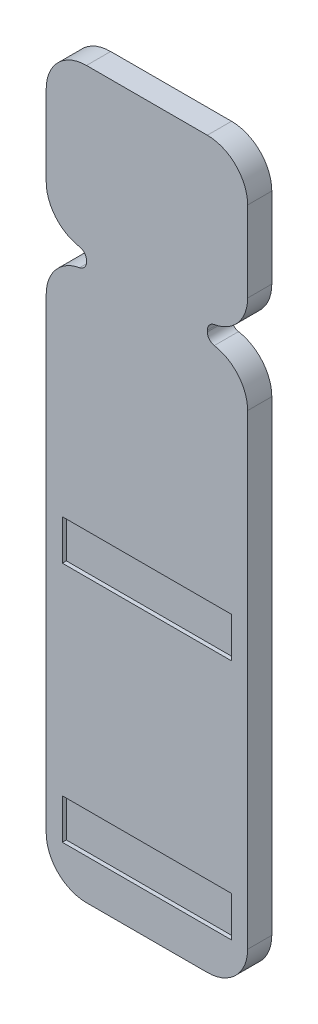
ISO-10303-21;
HEADER;
FILE_DESCRIPTION(('STEP AP214'),'2;1');
FILE_NAME('part.step','',(''),(''),'','','');
FILE_SCHEMA(('AUTOMOTIVE_DESIGN { 1 0 10303 214 1 1 1 1 }'));
ENDSEC;
DATA;
#1=APPLICATION_CONTEXT('core data for automotive mechanical design processes');
#2=APPLICATION_PROTOCOL_DEFINITION('international standard','automotive_design',2000,#1);
#3=PRODUCT_CONTEXT('',#1,'mechanical');
#4=PRODUCT('Part','Part','',(#3));
#5=PRODUCT_RELATED_PRODUCT_CATEGORY('part','',(#4));
#6=PRODUCT_DEFINITION_FORMATION('','',#4);
#7=PRODUCT_DEFINITION_CONTEXT('part definition',#1,'design');
#8=PRODUCT_DEFINITION('design','',#6,#7);
#9=PRODUCT_DEFINITION_SHAPE('','',#8);
#10=(LENGTH_UNIT() NAMED_UNIT(*) SI_UNIT(.MILLI.,.METRE.));
#11=(NAMED_UNIT(*) PLANE_ANGLE_UNIT() SI_UNIT($,.RADIAN.));
#12=(NAMED_UNIT(*) SI_UNIT($,.STERADIAN.) SOLID_ANGLE_UNIT());
#13=UNCERTAINTY_MEASURE_WITH_UNIT(LENGTH_MEASURE(1.E-05),#10,'distance_accuracy_value','');
#14=(GEOMETRIC_REPRESENTATION_CONTEXT(3) GLOBAL_UNCERTAINTY_ASSIGNED_CONTEXT((#13)) GLOBAL_UNIT_ASSIGNED_CONTEXT((#10,
#11,#12)) REPRESENTATION_CONTEXT('',''));
#15=CARTESIAN_POINT('',(0.,0.,0.));
#16=DIRECTION('',(0.,0.,1.));
#17=DIRECTION('',(1.,0.,0.));
#18=AXIS2_PLACEMENT_3D('',#15,#16,#17);
#19=CARTESIAN_POINT('',(-50.,40.,3.));
#20=DIRECTION('',(0.,-1.,0.));
#21=DIRECTION('',(0.,0.,-1.));
#22=AXIS2_PLACEMENT_3D('',#19,#20,#21);
#23=PLANE('',#22);
#24=DIRECTION('',(-1.,0.,0.));
#25=VECTOR('',#24,1.);
#26=CARTESIAN_POINT('',(-50.,40.,3.));
#27=LINE('',#26,#25);
#28=CARTESIAN_POINT('',(-30.,40.,3.));
#29=VERTEX_POINT('',#28);
#30=CARTESIAN_POINT('',(-45.,40.,3.));
#31=VERTEX_POINT('',#30);
#32=EDGE_CURVE('E302',#29,#31,#27,.T.);
#33=ORIENTED_EDGE('',*,*,#32,.F.);
#34=DIRECTION('',(0.,0.,-1.));
#35=VECTOR('',#34,1.);
#36=CARTESIAN_POINT('',(-30.,40.,3.));
#37=LINE('',#36,#35);
#38=CARTESIAN_POINT('',(-30.,40.,0.));
#39=VERTEX_POINT('',#38);
#40=EDGE_CURVE('E396',#29,#39,#37,.T.);
#41=ORIENTED_EDGE('',*,*,#40,.T.);
#42=DIRECTION('',(-1.,0.,0.));
#43=VECTOR('',#42,1.);
#44=CARTESIAN_POINT('',(-50.,40.,0.));
#45=LINE('',#44,#43);
#46=CARTESIAN_POINT('',(-45.,40.,0.));
#47=VERTEX_POINT('',#46);
#48=EDGE_CURVE('E275',#39,#47,#45,.T.);
#49=ORIENTED_EDGE('',*,*,#48,.T.);
#50=DIRECTION('',(0.,0.,-1.));
#51=VECTOR('',#50,1.);
#52=CARTESIAN_POINT('',(-45.,40.,3.));
#53=LINE('',#52,#51);
#54=EDGE_CURVE('E394',#47,#31,#53,.F.);
#55=ORIENTED_EDGE('',*,*,#54,.T.);
#56=EDGE_LOOP('',(#33,#41,#49,#55));
#57=FACE_BOUND('',#56,.T.);
#58=ADVANCED_FACE('F26',(#57),#23,.F.);
#59=CARTESIAN_POINT('',(-50.,40.,3.));
#60=DIRECTION('',(1.,0.,0.));
#61=DIRECTION('',(0.,1.,0.));
#62=AXIS2_PLACEMENT_3D('',#59,#60,#61);
#63=PLANE('',#62);
#64=DIRECTION('',(0.,-1.,0.));
#65=VECTOR('',#64,1.);
#66=CARTESIAN_POINT('',(-50.,40.,3.));
#67=LINE('',#66,#65);
#68=CARTESIAN_POINT('',(-50.,35.,3.));
#69=VERTEX_POINT('',#68);
#70=CARTESIAN_POINT('',(-50.,25.,3.));
#71=VERTEX_POINT('',#70);
#72=EDGE_CURVE('E305',#69,#71,#67,.T.);
#73=ORIENTED_EDGE('',*,*,#72,.F.);
#74=DIRECTION('',(0.,0.,-1.));
#75=VECTOR('',#74,1.);
#76=CARTESIAN_POINT('',(-50.,35.,3.));
#77=LINE('',#76,#75);
#78=CARTESIAN_POINT('',(-50.,35.,0.));
#79=VERTEX_POINT('',#78);
#80=EDGE_CURVE('E11',#69,#79,#77,.T.);
#81=ORIENTED_EDGE('',*,*,#80,.T.);
#82=DIRECTION('',(0.,-1.,0.));
#83=VECTOR('',#82,1.);
#84=CARTESIAN_POINT('',(-50.,40.,0.));
#85=LINE('',#84,#83);
#86=CARTESIAN_POINT('',(-50.,25.,0.));
#87=VERTEX_POINT('',#86);
#88=EDGE_CURVE('E283',#79,#87,#85,.T.);
#89=ORIENTED_EDGE('',*,*,#88,.T.);
#90=DIRECTION('',(0.,0.,-1.));
#91=VECTOR('',#90,1.);
#92=CARTESIAN_POINT('',(-50.,25.,3.));
#93=LINE('',#92,#91);
#94=EDGE_CURVE('E355',#87,#71,#93,.F.);
#95=ORIENTED_EDGE('',*,*,#94,.T.);
#96=EDGE_LOOP('',(#73,#81,#89,#95));
#97=FACE_BOUND('',#96,.T.);
#98=ADVANCED_FACE('F477',(#97),#63,.F.);
#99=CARTESIAN_POINT('',(-45.,20.,3.));
#100=DIRECTION('',(1.,0.,0.));
#101=DIRECTION('',(0.,0.,-1.));
#102=AXIS2_PLACEMENT_3D('',#99,#100,#101);
#103=PLANE('',#102);
#104=DIRECTION('',(0.,-1.,0.));
#105=VECTOR('',#104,1.);
#106=CARTESIAN_POINT('',(-45.,20.,0.));
#107=LINE('',#106,#105);
#108=CARTESIAN_POINT('',(-45.,19.0418123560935,0.));
#109=VERTEX_POINT('',#108);
#110=CARTESIAN_POINT('',(-45.,18.8581876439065,0.));
#111=VERTEX_POINT('',#110);
#112=EDGE_CURVE('E285',#109,#111,#107,.T.);
#113=ORIENTED_EDGE('',*,*,#112,.T.);
#114=DIRECTION('',(0.,0.,-1.));
#115=VECTOR('',#114,1.);
#116=CARTESIAN_POINT('',(-45.,18.8581876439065,3.));
#117=LINE('',#116,#115);
#118=CARTESIAN_POINT('',(-45.,18.8581876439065,3.));
#119=VERTEX_POINT('',#118);
#120=EDGE_CURVE('E374',#111,#119,#117,.F.);
#121=ORIENTED_EDGE('',*,*,#120,.T.);
#122=DIRECTION('',(0.,-1.,0.));
#123=VECTOR('',#122,1.);
#124=CARTESIAN_POINT('',(-45.,20.,3.));
#125=LINE('',#124,#123);
#126=CARTESIAN_POINT('',(-45.,19.0418123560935,3.));
#127=VERTEX_POINT('',#126);
#128=EDGE_CURVE('E307',#127,#119,#125,.T.);
#129=ORIENTED_EDGE('',*,*,#128,.F.);
#130=DIRECTION('',(0.,0.,-1.));
#131=VECTOR('',#130,1.);
#132=CARTESIAN_POINT('',(-45.,19.0418123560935,3.));
#133=LINE('',#132,#131);
#134=EDGE_CURVE('E371',#127,#109,#133,.T.);
#135=ORIENTED_EDGE('',*,*,#134,.T.);
#136=EDGE_LOOP('',(#113,#121,#129,#135));
#137=FACE_BOUND('',#136,.T.);
#138=ADVANCED_FACE('F492',(#137),#103,.F.);
#139=CARTESIAN_POINT('',(-50.,17.9,3.));
#140=DIRECTION('',(1.,0.,0.));
#141=DIRECTION('',(0.,1.,0.));
#142=AXIS2_PLACEMENT_3D('',#139,#140,#141);
#143=PLANE('',#142);
#144=DIRECTION('',(0.,-1.,0.));
#145=VECTOR('',#144,1.);
#146=CARTESIAN_POINT('',(-50.,17.9,0.));
#147=LINE('',#146,#145);
#148=CARTESIAN_POINT('',(-50.,12.9,0.));
#149=VERTEX_POINT('',#148);
#150=CARTESIAN_POINT('',(-50.,-45.,0.));
#151=VERTEX_POINT('',#150);
#152=EDGE_CURVE('E288',#149,#151,#147,.T.);
#153=ORIENTED_EDGE('',*,*,#152,.T.);
#154=DIRECTION('',(0.,0.,-1.));
#155=VECTOR('',#154,1.);
#156=CARTESIAN_POINT('',(-50.,-45.,3.));
#157=LINE('',#156,#155);
#158=CARTESIAN_POINT('',(-50.,-45.,3.));
#159=VERTEX_POINT('',#158);
#160=EDGE_CURVE('E422',#151,#159,#157,.F.);
#161=ORIENTED_EDGE('',*,*,#160,.T.);
#162=DIRECTION('',(0.,-1.,0.));
#163=VECTOR('',#162,1.);
#164=CARTESIAN_POINT('',(-50.,17.9,3.));
#165=LINE('',#164,#163);
#166=CARTESIAN_POINT('',(-50.,12.9,3.));
#167=VERTEX_POINT('',#166);
#168=EDGE_CURVE('E310',#167,#159,#165,.T.);
#169=ORIENTED_EDGE('',*,*,#168,.F.);
#170=DIRECTION('',(0.,0.,-1.));
#171=VECTOR('',#170,1.);
#172=CARTESIAN_POINT('',(-50.,12.9,3.));
#173=LINE('',#172,#171);
#174=EDGE_CURVE('E352',#167,#149,#173,.T.);
#175=ORIENTED_EDGE('',*,*,#174,.T.);
#176=EDGE_LOOP('',(#153,#161,#169,#175));
#177=FACE_BOUND('',#176,.T.);
#178=ADVANCED_FACE('F506',(#177),#143,.F.);
#179=CARTESIAN_POINT('',(-50.,-50.,3.));
#180=DIRECTION('',(0.,1.,0.));
#181=DIRECTION('',(0.,0.,1.));
#182=AXIS2_PLACEMENT_3D('',#179,#180,#181);
#183=PLANE('',#182);
#184=DIRECTION('',(1.,0.,0.));
#185=VECTOR('',#184,1.);
#186=CARTESIAN_POINT('',(-50.,-50.,3.));
#187=LINE('',#186,#185);
#188=CARTESIAN_POINT('',(-45.,-50.,3.));
#189=VERTEX_POINT('',#188);
#190=CARTESIAN_POINT('',(-30.,-50.,3.));
#191=VERTEX_POINT('',#190);
#192=EDGE_CURVE('E313',#189,#191,#187,.T.);
#193=ORIENTED_EDGE('',*,*,#192,.F.);
#194=DIRECTION('',(0.,0.,-1.));
#195=VECTOR('',#194,1.);
#196=CARTESIAN_POINT('',(-45.,-50.,3.));
#197=LINE('',#196,#195);
#198=CARTESIAN_POINT('',(-45.,-50.,0.));
#199=VERTEX_POINT('',#198);
#200=EDGE_CURVE('E419',#189,#199,#197,.T.);
#201=ORIENTED_EDGE('',*,*,#200,.T.);
#202=DIRECTION('',(1.,0.,0.));
#203=VECTOR('',#202,1.);
#204=CARTESIAN_POINT('',(-50.,-50.,0.));
#205=LINE('',#204,#203);
#206=CARTESIAN_POINT('',(-30.,-50.,0.));
#207=VERTEX_POINT('',#206);
#208=EDGE_CURVE('E291',#199,#207,#205,.T.);
#209=ORIENTED_EDGE('',*,*,#208,.T.);
#210=DIRECTION('',(0.,0.,-1.));
#211=VECTOR('',#210,1.);
#212=CARTESIAN_POINT('',(-30.,-50.,3.));
#213=LINE('',#212,#211);
#214=EDGE_CURVE('E417',#207,#191,#213,.F.);
#215=ORIENTED_EDGE('',*,*,#214,.T.);
#216=EDGE_LOOP('',(#193,#201,#209,#215));
#217=FACE_BOUND('',#216,.T.);
#218=ADVANCED_FACE('F513',(#217),#183,.F.);
#219=CARTESIAN_POINT('',(-25.,17.9,3.));
#220=DIRECTION('',(-1.,0.,0.));
#221=DIRECTION('',(0.,-1.,0.));
#222=AXIS2_PLACEMENT_3D('',#219,#220,#221);
#223=PLANE('',#222);
#224=DIRECTION('',(0.,1.,0.));
#225=VECTOR('',#224,1.);
#226=CARTESIAN_POINT('',(-25.,17.9,3.));
#227=LINE('',#226,#225);
#228=CARTESIAN_POINT('',(-25.,-45.,3.));
#229=VERTEX_POINT('',#228);
#230=CARTESIAN_POINT('',(-25.,12.9,3.));
#231=VERTEX_POINT('',#230);
#232=EDGE_CURVE('E316',#229,#231,#227,.T.);
#233=ORIENTED_EDGE('',*,*,#232,.F.);
#234=DIRECTION('',(0.,0.,-1.));
#235=VECTOR('',#234,1.);
#236=CARTESIAN_POINT('',(-25.,-45.,3.));
#237=LINE('',#236,#235);
#238=CARTESIAN_POINT('',(-25.,-45.,0.));
#239=VERTEX_POINT('',#238);
#240=EDGE_CURVE('E33',#229,#239,#237,.T.);
#241=ORIENTED_EDGE('',*,*,#240,.T.);
#242=DIRECTION('',(0.,1.,0.));
#243=VECTOR('',#242,1.);
#244=CARTESIAN_POINT('',(-25.,17.9,0.));
#245=LINE('',#244,#243);
#246=CARTESIAN_POINT('',(-25.,12.9,0.));
#247=VERTEX_POINT('',#246);
#248=EDGE_CURVE('E294',#239,#247,#245,.T.);
#249=ORIENTED_EDGE('',*,*,#248,.T.);
#250=DIRECTION('',(0.,0.,-1.));
#251=VECTOR('',#250,1.);
#252=CARTESIAN_POINT('',(-25.,12.9,3.));
#253=LINE('',#252,#251);
#254=EDGE_CURVE('E349',#247,#231,#253,.F.);
#255=ORIENTED_EDGE('',*,*,#254,.T.);
#256=EDGE_LOOP('',(#233,#241,#249,#255));
#257=FACE_BOUND('',#256,.T.);
#258=ADVANCED_FACE('F428',(#257),#223,.F.);
#259=CARTESIAN_POINT('',(-30.,20.,3.));
#260=DIRECTION('',(-1.,0.,0.));
#261=DIRECTION('',(0.,0.,1.));
#262=AXIS2_PLACEMENT_3D('',#259,#260,#261);
#263=PLANE('',#262);
#264=DIRECTION('',(0.,1.,0.));
#265=VECTOR('',#264,1.);
#266=CARTESIAN_POINT('',(-30.,20.,3.));
#267=LINE('',#266,#265);
#268=CARTESIAN_POINT('',(-30.,18.8581876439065,3.));
#269=VERTEX_POINT('',#268);
#270=CARTESIAN_POINT('',(-30.,19.0418123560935,3.));
#271=VERTEX_POINT('',#270);
#272=EDGE_CURVE('E318',#269,#271,#267,.T.);
#273=ORIENTED_EDGE('',*,*,#272,.F.);
#274=DIRECTION('',(0.,0.,-1.));
#275=VECTOR('',#274,1.);
#276=CARTESIAN_POINT('',(-30.,18.8581876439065,3.));
#277=LINE('',#276,#275);
#278=CARTESIAN_POINT('',(-30.,18.8581876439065,0.));
#279=VERTEX_POINT('',#278);
#280=EDGE_CURVE('E360',#269,#279,#277,.T.);
#281=ORIENTED_EDGE('',*,*,#280,.T.);
#282=DIRECTION('',(0.,1.,0.));
#283=VECTOR('',#282,1.);
#284=CARTESIAN_POINT('',(-30.,20.,0.));
#285=LINE('',#284,#283);
#286=CARTESIAN_POINT('',(-30.,19.0418123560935,0.));
#287=VERTEX_POINT('',#286);
#288=EDGE_CURVE('E296',#279,#287,#285,.T.);
#289=ORIENTED_EDGE('',*,*,#288,.T.);
#290=DIRECTION('',(0.,0.,-1.));
#291=VECTOR('',#290,1.);
#292=CARTESIAN_POINT('',(-30.,19.0418123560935,3.));
#293=LINE('',#292,#291);
#294=EDGE_CURVE('E358',#287,#271,#293,.F.);
#295=ORIENTED_EDGE('',*,*,#294,.T.);
#296=EDGE_LOOP('',(#273,#281,#289,#295));
#297=FACE_BOUND('',#296,.T.);
#298=ADVANCED_FACE('F449',(#297),#263,.F.);
#299=CARTESIAN_POINT('',(-25.,40.,3.));
#300=DIRECTION('',(-1.,0.,0.));
#301=DIRECTION('',(0.,-1.,0.));
#302=AXIS2_PLACEMENT_3D('',#299,#300,#301);
#303=PLANE('',#302);
#304=DIRECTION('',(0.,1.,0.));
#305=VECTOR('',#304,1.);
#306=CARTESIAN_POINT('',(-25.,40.,0.));
#307=LINE('',#306,#305);
#308=CARTESIAN_POINT('',(-25.,25.,0.));
#309=VERTEX_POINT('',#308);
#310=CARTESIAN_POINT('',(-25.,35.,0.));
#311=VERTEX_POINT('',#310);
#312=EDGE_CURVE('E299',#309,#311,#307,.T.);
#313=ORIENTED_EDGE('',*,*,#312,.T.);
#314=DIRECTION('',(0.,0.,-1.));
#315=VECTOR('',#314,1.);
#316=CARTESIAN_POINT('',(-25.,35.,3.));
#317=LINE('',#316,#315);
#318=CARTESIAN_POINT('',(-25.,35.,3.));
#319=VERTEX_POINT('',#318);
#320=EDGE_CURVE('E407',#311,#319,#317,.F.);
#321=ORIENTED_EDGE('',*,*,#320,.T.);
#322=DIRECTION('',(0.,1.,0.));
#323=VECTOR('',#322,1.);
#324=CARTESIAN_POINT('',(-25.,40.,3.));
#325=LINE('',#324,#323);
#326=CARTESIAN_POINT('',(-25.,25.,3.));
#327=VERTEX_POINT('',#326);
#328=EDGE_CURVE('E321',#327,#319,#325,.T.);
#329=ORIENTED_EDGE('',*,*,#328,.F.);
#330=DIRECTION('',(0.,0.,-1.));
#331=VECTOR('',#330,1.);
#332=CARTESIAN_POINT('',(-25.,25.,3.));
#333=LINE('',#332,#331);
#334=EDGE_CURVE('E324',#327,#309,#333,.T.);
#335=ORIENTED_EDGE('',*,*,#334,.T.);
#336=EDGE_LOOP('',(#313,#321,#329,#335));
#337=FACE_BOUND('',#336,.T.);
#338=ADVANCED_FACE('F463',(#337),#303,.F.);
#339=CARTESIAN_POINT('',(-30.,40.,3.));
#340=DIRECTION('',(0.,0.,-1.));
#341=DIRECTION('',(-1.,0.,0.));
#342=AXIS2_PLACEMENT_3D('',#339,#340,#341);
#343=PLANE('',#342);
#344=DIRECTION('',(1.,0.,0.));
#345=VECTOR('',#344,1.);
#346=CARTESIAN_POINT('',(-48.,-45.,3.));
#347=LINE('',#346,#345);
#348=CARTESIAN_POINT('',(-48.,-45.,3.));
#349=VERTEX_POINT('',#348);
#350=CARTESIAN_POINT('',(-27.,-45.,3.));
#351=VERTEX_POINT('',#350);
#352=EDGE_CURVE('E225',#349,#351,#347,.T.);
#353=ORIENTED_EDGE('',*,*,#352,.F.);
#354=DIRECTION('',(0.,-1.,0.));
#355=VECTOR('',#354,1.);
#356=CARTESIAN_POINT('',(-48.,-40.,3.));
#357=LINE('',#356,#355);
#358=CARTESIAN_POINT('',(-48.,-40.,3.));
#359=VERTEX_POINT('',#358);
#360=EDGE_CURVE('E40',#359,#349,#357,.T.);
#361=ORIENTED_EDGE('',*,*,#360,.F.);
#362=DIRECTION('',(-1.,0.,0.));
#363=VECTOR('',#362,1.);
#364=CARTESIAN_POINT('',(-48.,-40.,3.));
#365=LINE('',#364,#363);
#366=CARTESIAN_POINT('',(-27.,-40.,3.));
#367=VERTEX_POINT('',#366);
#368=EDGE_CURVE('E232',#367,#359,#365,.T.);
#369=ORIENTED_EDGE('',*,*,#368,.F.);
#370=DIRECTION('',(0.,1.,0.));
#371=VECTOR('',#370,1.);
#372=CARTESIAN_POINT('',(-27.,-40.,3.));
#373=LINE('',#372,#371);
#374=EDGE_CURVE('E214',#351,#367,#373,.T.);
#375=ORIENTED_EDGE('',*,*,#374,.F.);
#376=EDGE_LOOP('',(#353,#361,#369,#375));
#377=FACE_BOUND('',#376,.T.);
#378=DIRECTION('',(1.,0.,0.));
#379=VECTOR('',#378,1.);
#380=CARTESIAN_POINT('',(-48.,-15.,3.));
#381=LINE('',#380,#379);
#382=CARTESIAN_POINT('',(-48.,-15.,3.));
#383=VERTEX_POINT('',#382);
#384=CARTESIAN_POINT('',(-27.,-15.,3.));
#385=VERTEX_POINT('',#384);
#386=EDGE_CURVE('E251',#383,#385,#381,.T.);
#387=ORIENTED_EDGE('',*,*,#386,.F.);
#388=DIRECTION('',(0.,-1.,0.));
#389=VECTOR('',#388,1.);
#390=CARTESIAN_POINT('',(-48.,-10.,3.));
#391=LINE('',#390,#389);
#392=CARTESIAN_POINT('',(-48.,-10.,3.));
#393=VERTEX_POINT('',#392);
#394=EDGE_CURVE('E48',#393,#383,#391,.T.);
#395=ORIENTED_EDGE('',*,*,#394,.F.);
#396=DIRECTION('',(-1.,0.,0.));
#397=VECTOR('',#396,1.);
#398=CARTESIAN_POINT('',(-48.,-10.,3.));
#399=LINE('',#398,#397);
#400=CARTESIAN_POINT('',(-27.,-10.,3.));
#401=VERTEX_POINT('',#400);
#402=EDGE_CURVE('E257',#401,#393,#399,.T.);
#403=ORIENTED_EDGE('',*,*,#402,.F.);
#404=DIRECTION('',(0.,1.,0.));
#405=VECTOR('',#404,1.);
#406=CARTESIAN_POINT('',(-27.,-10.,3.));
#407=LINE('',#406,#405);
#408=EDGE_CURVE('E254',#385,#401,#407,.T.);
#409=ORIENTED_EDGE('',*,*,#408,.F.);
#410=EDGE_LOOP('',(#387,#395,#403,#409));
#411=FACE_BOUND('',#410,.T.);
#412=ORIENTED_EDGE('',*,*,#328,.T.);
#413=CARTESIAN_POINT('',(-30.,35.,3.));
#414=DIRECTION('',(0.,0.,-1.));
#415=DIRECTION('',(-1.,0.,0.));
#416=AXIS2_PLACEMENT_3D('',#413,#414,#415);
#417=CIRCLE('',#416,5.);
#418=EDGE_CURVE('E415',#319,#29,#417,.F.);
#419=ORIENTED_EDGE('',*,*,#418,.T.);
#420=ORIENTED_EDGE('',*,*,#32,.T.);
#421=CARTESIAN_POINT('',(-45.,35.,3.));
#422=DIRECTION('',(0.,0.,-1.));
#423=DIRECTION('',(-1.,0.,0.));
#424=AXIS2_PLACEMENT_3D('',#421,#422,#423);
#425=CIRCLE('',#424,5.);
#426=EDGE_CURVE('E409',#31,#69,#425,.F.);
#427=ORIENTED_EDGE('',*,*,#426,.T.);
#428=ORIENTED_EDGE('',*,*,#72,.T.);
#429=CARTESIAN_POINT('',(-45.,25.,3.));
#430=DIRECTION('',(0.,0.,-1.));
#431=DIRECTION('',(-1.,0.,0.));
#432=AXIS2_PLACEMENT_3D('',#429,#430,#431);
#433=CIRCLE('',#432,5.);
#434=CARTESIAN_POINT('',(-45.8677685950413,20.0758779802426,3.));
#435=VERTEX_POINT('',#434);
#436=EDGE_CURVE('E339',#71,#435,#433,.F.);
#437=ORIENTED_EDGE('',*,*,#436,.T.);
#438=CARTESIAN_POINT('',(-46.05,19.0418123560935,3.));
#439=DIRECTION('',(0.,0.,-1.));
#440=DIRECTION('',(-1.,0.,0.));
#441=AXIS2_PLACEMENT_3D('',#438,#439,#440);
#442=CIRCLE('',#441,1.05);
#443=EDGE_CURVE('E392',#435,#127,#442,.T.);
#444=ORIENTED_EDGE('',*,*,#443,.T.);
#445=ORIENTED_EDGE('',*,*,#128,.T.);
#446=CARTESIAN_POINT('',(-46.05,18.8581876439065,3.));
#447=DIRECTION('',(0.,0.,-1.));
#448=DIRECTION('',(-1.,0.,0.));
#449=AXIS2_PLACEMENT_3D('',#446,#447,#448);
#450=CIRCLE('',#449,1.05);
#451=CARTESIAN_POINT('',(-45.8677685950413,17.8241220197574,3.));
#452=VERTEX_POINT('',#451);
#453=EDGE_CURVE('E388',#119,#452,#450,.T.);
#454=ORIENTED_EDGE('',*,*,#453,.T.);
#455=CARTESIAN_POINT('',(-45.,12.9,3.));
#456=DIRECTION('',(0.,0.,-1.));
#457=DIRECTION('',(-1.,0.,0.));
#458=AXIS2_PLACEMENT_3D('',#455,#456,#457);
#459=CIRCLE('',#458,5.);
#460=EDGE_CURVE('E342',#452,#167,#459,.F.);
#461=ORIENTED_EDGE('',*,*,#460,.T.);
#462=ORIENTED_EDGE('',*,*,#168,.T.);
#463=CARTESIAN_POINT('',(-45.,-45.,3.));
#464=DIRECTION('',(0.,0.,-1.));
#465=DIRECTION('',(-1.,0.,0.));
#466=AXIS2_PLACEMENT_3D('',#463,#464,#465);
#467=CIRCLE('',#466,5.);
#468=EDGE_CURVE('E413',#159,#189,#467,.F.);
#469=ORIENTED_EDGE('',*,*,#468,.T.);
#470=ORIENTED_EDGE('',*,*,#192,.T.);
#471=CARTESIAN_POINT('',(-30.,-45.,3.));
#472=DIRECTION('',(0.,0.,-1.));
#473=DIRECTION('',(-1.,0.,0.));
#474=AXIS2_PLACEMENT_3D('',#471,#472,#473);
#475=CIRCLE('',#474,5.);
#476=EDGE_CURVE('E411',#191,#229,#475,.F.);
#477=ORIENTED_EDGE('',*,*,#476,.T.);
#478=ORIENTED_EDGE('',*,*,#232,.T.);
#479=CARTESIAN_POINT('',(-30.,12.9,3.));
#480=DIRECTION('',(0.,0.,-1.));
#481=DIRECTION('',(-1.,0.,0.));
#482=AXIS2_PLACEMENT_3D('',#479,#480,#481);
#483=CIRCLE('',#482,5.);
#484=CARTESIAN_POINT('',(-29.1322314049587,17.8241220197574,3.));
#485=VERTEX_POINT('',#484);
#486=EDGE_CURVE('E344',#231,#485,#483,.F.);
#487=ORIENTED_EDGE('',*,*,#486,.T.);
#488=CARTESIAN_POINT('',(-28.95,18.8581876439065,3.));
#489=DIRECTION('',(0.,0.,-1.));
#490=DIRECTION('',(-1.,0.,0.));
#491=AXIS2_PLACEMENT_3D('',#488,#489,#490);
#492=CIRCLE('',#491,1.05);
#493=EDGE_CURVE('E380',#485,#269,#492,.T.);
#494=ORIENTED_EDGE('',*,*,#493,.T.);
#495=ORIENTED_EDGE('',*,*,#272,.T.);
#496=CARTESIAN_POINT('',(-28.95,19.0418123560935,3.));
#497=DIRECTION('',(0.,0.,-1.));
#498=DIRECTION('',(-1.,0.,0.));
#499=AXIS2_PLACEMENT_3D('',#496,#497,#498);
#500=CIRCLE('',#499,1.05);
#501=CARTESIAN_POINT('',(-29.1322314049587,20.0758779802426,3.));
#502=VERTEX_POINT('',#501);
#503=EDGE_CURVE('E384',#271,#502,#500,.T.);
#504=ORIENTED_EDGE('',*,*,#503,.T.);
#505=CARTESIAN_POINT('',(-30.,25.,3.));
#506=DIRECTION('',(0.,0.,-1.));
#507=DIRECTION('',(-1.,0.,0.));
#508=AXIS2_PLACEMENT_3D('',#505,#506,#507);
#509=CIRCLE('',#508,5.);
#510=EDGE_CURVE('E347',#502,#327,#509,.F.);
#511=ORIENTED_EDGE('',*,*,#510,.T.);
#512=EDGE_LOOP('',(#412,#419,#420,#427,#428,#437,#444,#445,#454,#461,#462,#469,#470,#477,#478,
#487,#494,#495,#504,#511));
#513=FACE_BOUND('',#512,.T.);
#514=ADVANCED_FACE('F229',(#377,#411,#513),#343,.F.);
#515=CARTESIAN_POINT('',(-30.,40.,0.));
#516=DIRECTION('',(0.,0.,-1.));
#517=DIRECTION('',(-1.,0.,0.));
#518=AXIS2_PLACEMENT_3D('',#515,#516,#517);
#519=PLANE('',#518);
#520=ORIENTED_EDGE('',*,*,#48,.F.);
#521=CARTESIAN_POINT('',(-30.,35.,0.));
#522=DIRECTION('',(0.,0.,-1.));
#523=DIRECTION('',(-1.,0.,0.));
#524=AXIS2_PLACEMENT_3D('',#521,#522,#523);
#525=CIRCLE('',#524,5.);
#526=EDGE_CURVE('E405',#39,#311,#525,.T.);
#527=ORIENTED_EDGE('',*,*,#526,.T.);
#528=ORIENTED_EDGE('',*,*,#312,.F.);
#529=CARTESIAN_POINT('',(-30.,25.,0.));
#530=DIRECTION('',(0.,0.,-1.));
#531=DIRECTION('',(-1.,0.,0.));
#532=AXIS2_PLACEMENT_3D('',#529,#530,#531);
#533=CIRCLE('',#532,5.);
#534=CARTESIAN_POINT('',(-29.1322314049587,20.0758779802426,0.));
#535=VERTEX_POINT('',#534);
#536=EDGE_CURVE('E336',#309,#535,#533,.T.);
#537=ORIENTED_EDGE('',*,*,#536,.T.);
#538=CARTESIAN_POINT('',(-28.95,19.0418123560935,0.));
#539=DIRECTION('',(0.,0.,-1.));
#540=DIRECTION('',(-1.,0.,0.));
#541=AXIS2_PLACEMENT_3D('',#538,#539,#540);
#542=CIRCLE('',#541,1.05);
#543=EDGE_CURVE('E382',#535,#287,#542,.F.);
#544=ORIENTED_EDGE('',*,*,#543,.T.);
#545=ORIENTED_EDGE('',*,*,#288,.F.);
#546=CARTESIAN_POINT('',(-28.95,18.8581876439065,0.));
#547=DIRECTION('',(0.,0.,-1.));
#548=DIRECTION('',(-1.,0.,0.));
#549=AXIS2_PLACEMENT_3D('',#546,#547,#548);
#550=CIRCLE('',#549,1.05);
#551=CARTESIAN_POINT('',(-29.1322314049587,17.8241220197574,0.));
#552=VERTEX_POINT('',#551);
#553=EDGE_CURVE('E378',#279,#552,#550,.F.);
#554=ORIENTED_EDGE('',*,*,#553,.T.);
#555=CARTESIAN_POINT('',(-30.,12.9,0.));
#556=DIRECTION('',(0.,0.,-1.));
#557=DIRECTION('',(-1.,0.,0.));
#558=AXIS2_PLACEMENT_3D('',#555,#556,#557);
#559=CIRCLE('',#558,5.);
#560=EDGE_CURVE('E333',#552,#247,#559,.T.);
#561=ORIENTED_EDGE('',*,*,#560,.T.);
#562=ORIENTED_EDGE('',*,*,#248,.F.);
#563=CARTESIAN_POINT('',(-30.,-45.,0.));
#564=DIRECTION('',(0.,0.,-1.));
#565=DIRECTION('',(-1.,0.,0.));
#566=AXIS2_PLACEMENT_3D('',#563,#564,#565);
#567=CIRCLE('',#566,5.);
#568=EDGE_CURVE('E401',#239,#207,#567,.T.);
#569=ORIENTED_EDGE('',*,*,#568,.T.);
#570=ORIENTED_EDGE('',*,*,#208,.F.);
#571=CARTESIAN_POINT('',(-45.,-45.,0.));
#572=DIRECTION('',(0.,0.,-1.));
#573=DIRECTION('',(-1.,0.,0.));
#574=AXIS2_PLACEMENT_3D('',#571,#572,#573);
#575=CIRCLE('',#574,5.);
#576=EDGE_CURVE('E403',#199,#151,#575,.T.);
#577=ORIENTED_EDGE('',*,*,#576,.T.);
#578=ORIENTED_EDGE('',*,*,#152,.F.);
#579=CARTESIAN_POINT('',(-45.,12.9,0.));
#580=DIRECTION('',(0.,0.,-1.));
#581=DIRECTION('',(-1.,0.,0.));
#582=AXIS2_PLACEMENT_3D('',#579,#580,#581);
#583=CIRCLE('',#582,5.);
#584=CARTESIAN_POINT('',(-45.8677685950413,17.8241220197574,0.));
#585=VERTEX_POINT('',#584);
#586=EDGE_CURVE('E330',#149,#585,#583,.T.);
#587=ORIENTED_EDGE('',*,*,#586,.T.);
#588=CARTESIAN_POINT('',(-46.05,18.8581876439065,0.));
#589=DIRECTION('',(0.,0.,-1.));
#590=DIRECTION('',(-1.,0.,0.));
#591=AXIS2_PLACEMENT_3D('',#588,#589,#590);
#592=CIRCLE('',#591,1.05);
#593=EDGE_CURVE('E386',#585,#111,#592,.F.);
#594=ORIENTED_EDGE('',*,*,#593,.T.);
#595=ORIENTED_EDGE('',*,*,#112,.F.);
#596=CARTESIAN_POINT('',(-46.05,19.0418123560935,0.));
#597=DIRECTION('',(0.,0.,-1.));
#598=DIRECTION('',(-1.,0.,0.));
#599=AXIS2_PLACEMENT_3D('',#596,#597,#598);
#600=CIRCLE('',#599,1.05);
#601=CARTESIAN_POINT('',(-45.8677685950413,20.0758779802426,0.));
#602=VERTEX_POINT('',#601);
#603=EDGE_CURVE('E390',#109,#602,#600,.F.);
#604=ORIENTED_EDGE('',*,*,#603,.T.);
#605=CARTESIAN_POINT('',(-45.,25.,0.));
#606=DIRECTION('',(0.,0.,-1.));
#607=DIRECTION('',(-1.,0.,0.));
#608=AXIS2_PLACEMENT_3D('',#605,#606,#607);
#609=CIRCLE('',#608,5.);
#610=EDGE_CURVE('E327',#602,#87,#609,.T.);
#611=ORIENTED_EDGE('',*,*,#610,.T.);
#612=ORIENTED_EDGE('',*,*,#88,.F.);
#613=CARTESIAN_POINT('',(-45.,35.,0.));
#614=DIRECTION('',(0.,0.,-1.));
#615=DIRECTION('',(-1.,0.,0.));
#616=AXIS2_PLACEMENT_3D('',#613,#614,#615);
#617=CIRCLE('',#616,5.);
#618=EDGE_CURVE('E399',#79,#47,#617,.T.);
#619=ORIENTED_EDGE('',*,*,#618,.T.);
#620=EDGE_LOOP('',(#520,#527,#528,#537,#544,#545,#554,#561,#562,#569,#570,#577,#578,#587,#594,
#595,#604,#611,#612,#619));
#621=FACE_BOUND('',#620,.T.);
#622=ADVANCED_FACE('F433',(#621),#519,.T.);
#623=CARTESIAN_POINT('',(-30.,25.,3.));
#624=DIRECTION('',(0.,0.,-1.));
#625=DIRECTION('',(-1.,0.,0.));
#626=AXIS2_PLACEMENT_3D('',#623,#624,#625);
#627=CYLINDRICAL_SURFACE('',#626,5.);
#628=ORIENTED_EDGE('',*,*,#510,.F.);
#629=DIRECTION('',(0.,0.,-1.));
#630=VECTOR('',#629,1.);
#631=CARTESIAN_POINT('',(-29.1322314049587,20.0758779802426,3.));
#632=LINE('',#631,#630);
#633=EDGE_CURVE('E365',#502,#535,#632,.T.);
#634=ORIENTED_EDGE('',*,*,#633,.T.);
#635=ORIENTED_EDGE('',*,*,#536,.F.);
#636=ORIENTED_EDGE('',*,*,#334,.F.);
#637=EDGE_LOOP('',(#628,#634,#635,#636));
#638=FACE_BOUND('',#637,.T.);
#639=ADVANCED_FACE('F458',(#638),#627,.T.);
#640=CARTESIAN_POINT('',(-30.,12.9,3.));
#641=DIRECTION('',(0.,0.,-1.));
#642=DIRECTION('',(-1.,0.,0.));
#643=AXIS2_PLACEMENT_3D('',#640,#641,#642);
#644=CYLINDRICAL_SURFACE('',#643,5.);
#645=ORIENTED_EDGE('',*,*,#560,.F.);
#646=DIRECTION('',(0.,0.,-1.));
#647=VECTOR('',#646,1.);
#648=CARTESIAN_POINT('',(-29.1322314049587,17.8241220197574,3.));
#649=LINE('',#648,#647);
#650=EDGE_CURVE('E363',#552,#485,#649,.F.);
#651=ORIENTED_EDGE('',*,*,#650,.T.);
#652=ORIENTED_EDGE('',*,*,#486,.F.);
#653=ORIENTED_EDGE('',*,*,#254,.F.);
#654=EDGE_LOOP('',(#645,#651,#652,#653));
#655=FACE_BOUND('',#654,.T.);
#656=ADVANCED_FACE('F441',(#655),#644,.T.);
#657=CARTESIAN_POINT('',(-45.,12.9,3.));
#658=DIRECTION('',(0.,0.,-1.));
#659=DIRECTION('',(-1.,0.,0.));
#660=AXIS2_PLACEMENT_3D('',#657,#658,#659);
#661=CYLINDRICAL_SURFACE('',#660,5.);
#662=ORIENTED_EDGE('',*,*,#460,.F.);
#663=DIRECTION('',(0.,0.,-1.));
#664=VECTOR('',#663,1.);
#665=CARTESIAN_POINT('',(-45.8677685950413,17.8241220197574,3.));
#666=LINE('',#665,#664);
#667=EDGE_CURVE('E368',#452,#585,#666,.T.);
#668=ORIENTED_EDGE('',*,*,#667,.T.);
#669=ORIENTED_EDGE('',*,*,#586,.F.);
#670=ORIENTED_EDGE('',*,*,#174,.F.);
#671=EDGE_LOOP('',(#662,#668,#669,#670));
#672=FACE_BOUND('',#671,.T.);
#673=ADVANCED_FACE('F501',(#672),#661,.T.);
#674=CARTESIAN_POINT('',(-45.,25.,3.));
#675=DIRECTION('',(0.,0.,-1.));
#676=DIRECTION('',(-1.,0.,0.));
#677=AXIS2_PLACEMENT_3D('',#674,#675,#676);
#678=CYLINDRICAL_SURFACE('',#677,5.);
#679=ORIENTED_EDGE('',*,*,#610,.F.);
#680=DIRECTION('',(0.,0.,-1.));
#681=VECTOR('',#680,1.);
#682=CARTESIAN_POINT('',(-45.8677685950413,20.0758779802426,3.));
#683=LINE('',#682,#681);
#684=EDGE_CURVE('E376',#602,#435,#683,.F.);
#685=ORIENTED_EDGE('',*,*,#684,.T.);
#686=ORIENTED_EDGE('',*,*,#436,.F.);
#687=ORIENTED_EDGE('',*,*,#94,.F.);
#688=EDGE_LOOP('',(#679,#685,#686,#687));
#689=FACE_BOUND('',#688,.T.);
#690=ADVANCED_FACE('F483',(#689),#678,.T.);
#691=CARTESIAN_POINT('',(-28.95,18.8581876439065,3.));
#692=DIRECTION('',(0.,0.,-1.));
#693=DIRECTION('',(-1.,0.,0.));
#694=AXIS2_PLACEMENT_3D('',#691,#692,#693);
#695=CYLINDRICAL_SURFACE('',#694,1.05);
#696=ORIENTED_EDGE('',*,*,#493,.F.);
#697=ORIENTED_EDGE('',*,*,#650,.F.);
#698=ORIENTED_EDGE('',*,*,#553,.F.);
#699=ORIENTED_EDGE('',*,*,#280,.F.);
#700=EDGE_LOOP('',(#696,#697,#698,#699));
#701=FACE_BOUND('',#700,.T.);
#702=ADVANCED_FACE('F447',(#701),#695,.F.);
#703=CARTESIAN_POINT('',(-28.95,19.0418123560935,3.));
#704=DIRECTION('',(0.,0.,-1.));
#705=DIRECTION('',(-1.,0.,0.));
#706=AXIS2_PLACEMENT_3D('',#703,#704,#705);
#707=CYLINDRICAL_SURFACE('',#706,1.05);
#708=ORIENTED_EDGE('',*,*,#503,.F.);
#709=ORIENTED_EDGE('',*,*,#294,.F.);
#710=ORIENTED_EDGE('',*,*,#543,.F.);
#711=ORIENTED_EDGE('',*,*,#633,.F.);
#712=EDGE_LOOP('',(#708,#709,#710,#711));
#713=FACE_BOUND('',#712,.T.);
#714=ADVANCED_FACE('F455',(#713),#707,.F.);
#715=CARTESIAN_POINT('',(-46.05,18.8581876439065,3.));
#716=DIRECTION('',(0.,0.,-1.));
#717=DIRECTION('',(-1.,0.,0.));
#718=AXIS2_PLACEMENT_3D('',#715,#716,#717);
#719=CYLINDRICAL_SURFACE('',#718,1.05);
#720=ORIENTED_EDGE('',*,*,#453,.F.);
#721=ORIENTED_EDGE('',*,*,#120,.F.);
#722=ORIENTED_EDGE('',*,*,#593,.F.);
#723=ORIENTED_EDGE('',*,*,#667,.F.);
#724=EDGE_LOOP('',(#720,#721,#722,#723));
#725=FACE_BOUND('',#724,.T.);
#726=ADVANCED_FACE('F498',(#725),#719,.F.);
#727=CARTESIAN_POINT('',(-46.05,19.0418123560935,3.));
#728=DIRECTION('',(0.,0.,-1.));
#729=DIRECTION('',(-1.,0.,0.));
#730=AXIS2_PLACEMENT_3D('',#727,#728,#729);
#731=CYLINDRICAL_SURFACE('',#730,1.05);
#732=ORIENTED_EDGE('',*,*,#443,.F.);
#733=ORIENTED_EDGE('',*,*,#684,.F.);
#734=ORIENTED_EDGE('',*,*,#603,.F.);
#735=ORIENTED_EDGE('',*,*,#134,.F.);
#736=EDGE_LOOP('',(#732,#733,#734,#735));
#737=FACE_BOUND('',#736,.T.);
#738=ADVANCED_FACE('F489',(#737),#731,.F.);
#739=CARTESIAN_POINT('',(-30.,35.,3.));
#740=DIRECTION('',(0.,0.,-1.));
#741=DIRECTION('',(-1.,0.,0.));
#742=AXIS2_PLACEMENT_3D('',#739,#740,#741);
#743=CYLINDRICAL_SURFACE('',#742,5.);
#744=ORIENTED_EDGE('',*,*,#418,.F.);
#745=ORIENTED_EDGE('',*,*,#320,.F.);
#746=ORIENTED_EDGE('',*,*,#526,.F.);
#747=ORIENTED_EDGE('',*,*,#40,.F.);
#748=EDGE_LOOP('',(#744,#745,#746,#747));
#749=FACE_BOUND('',#748,.T.);
#750=ADVANCED_FACE('F466',(#749),#743,.T.);
#751=CARTESIAN_POINT('',(-45.,-45.,3.));
#752=DIRECTION('',(0.,0.,-1.));
#753=DIRECTION('',(-1.,0.,0.));
#754=AXIS2_PLACEMENT_3D('',#751,#752,#753);
#755=CYLINDRICAL_SURFACE('',#754,5.);
#756=ORIENTED_EDGE('',*,*,#468,.F.);
#757=ORIENTED_EDGE('',*,*,#160,.F.);
#758=ORIENTED_EDGE('',*,*,#576,.F.);
#759=ORIENTED_EDGE('',*,*,#200,.F.);
#760=EDGE_LOOP('',(#756,#757,#758,#759));
#761=FACE_BOUND('',#760,.T.);
#762=ADVANCED_FACE('F509',(#761),#755,.T.);
#763=CARTESIAN_POINT('',(-30.,-45.,3.));
#764=DIRECTION('',(0.,0.,-1.));
#765=DIRECTION('',(-1.,0.,0.));
#766=AXIS2_PLACEMENT_3D('',#763,#764,#765);
#767=CYLINDRICAL_SURFACE('',#766,5.);
#768=ORIENTED_EDGE('',*,*,#476,.F.);
#769=ORIENTED_EDGE('',*,*,#214,.F.);
#770=ORIENTED_EDGE('',*,*,#568,.F.);
#771=ORIENTED_EDGE('',*,*,#240,.F.);
#772=EDGE_LOOP('',(#768,#769,#770,#771));
#773=FACE_BOUND('',#772,.T.);
#774=ADVANCED_FACE('F515',(#773),#767,.T.);
#775=CARTESIAN_POINT('',(-45.,35.,3.));
#776=DIRECTION('',(0.,0.,-1.));
#777=DIRECTION('',(-1.,0.,0.));
#778=AXIS2_PLACEMENT_3D('',#775,#776,#777);
#779=CYLINDRICAL_SURFACE('',#778,5.);
#780=ORIENTED_EDGE('',*,*,#426,.F.);
#781=ORIENTED_EDGE('',*,*,#54,.F.);
#782=ORIENTED_EDGE('',*,*,#618,.F.);
#783=ORIENTED_EDGE('',*,*,#80,.F.);
#784=EDGE_LOOP('',(#780,#781,#782,#783));
#785=FACE_BOUND('',#784,.T.);
#786=ADVANCED_FACE('F473',(#785),#779,.T.);
#787=CARTESIAN_POINT('',(-48.,-10.,2.5));
#788=DIRECTION('',(-1.,0.,0.));
#789=DIRECTION('',(0.,0.,1.));
#790=AXIS2_PLACEMENT_3D('',#787,#788,#789);
#791=PLANE('',#790);
#792=ORIENTED_EDGE('',*,*,#394,.T.);
#793=DIRECTION('',(0.,0.,1.));
#794=VECTOR('',#793,1.);
#795=CARTESIAN_POINT('',(-48.,-15.,2.5));
#796=LINE('',#795,#794);
#797=CARTESIAN_POINT('',(-48.,-15.,2.5));
#798=VERTEX_POINT('',#797);
#799=EDGE_CURVE('E272',#798,#383,#796,.T.);
#800=ORIENTED_EDGE('',*,*,#799,.F.);
#801=DIRECTION('',(0.,-1.,0.));
#802=VECTOR('',#801,1.);
#803=CARTESIAN_POINT('',(-48.,-10.,2.5));
#804=LINE('',#803,#802);
#805=CARTESIAN_POINT('',(-48.,-10.,2.5));
#806=VERTEX_POINT('',#805);
#807=EDGE_CURVE('E260',#806,#798,#804,.T.);
#808=ORIENTED_EDGE('',*,*,#807,.F.);
#809=DIRECTION('',(0.,0.,1.));
#810=VECTOR('',#809,1.);
#811=CARTESIAN_POINT('',(-48.,-10.,2.5));
#812=LINE('',#811,#810);
#813=EDGE_CURVE('E273',#806,#393,#812,.T.);
#814=ORIENTED_EDGE('',*,*,#813,.T.);
#815=EDGE_LOOP('',(#792,#800,#808,#814));
#816=FACE_BOUND('',#815,.T.);
#817=ADVANCED_FACE('F522',(#816),#791,.F.);
#818=CARTESIAN_POINT('',(-48.,-10.,2.5));
#819=DIRECTION('',(0.,1.,0.));
#820=DIRECTION('',(0.,0.,1.));
#821=AXIS2_PLACEMENT_3D('',#818,#819,#820);
#822=PLANE('',#821);
#823=ORIENTED_EDGE('',*,*,#402,.T.);
#824=ORIENTED_EDGE('',*,*,#813,.F.);
#825=DIRECTION('',(-1.,0.,0.));
#826=VECTOR('',#825,1.);
#827=CARTESIAN_POINT('',(-48.,-10.,2.5));
#828=LINE('',#827,#826);
#829=CARTESIAN_POINT('',(-27.,-10.,2.5));
#830=VERTEX_POINT('',#829);
#831=EDGE_CURVE('E269',#830,#806,#828,.T.);
#832=ORIENTED_EDGE('',*,*,#831,.F.);
#833=DIRECTION('',(0.,0.,1.));
#834=VECTOR('',#833,1.);
#835=CARTESIAN_POINT('',(-27.,-10.,2.5));
#836=LINE('',#835,#834);
#837=EDGE_CURVE('E276',#830,#401,#836,.T.);
#838=ORIENTED_EDGE('',*,*,#837,.T.);
#839=EDGE_LOOP('',(#823,#824,#832,#838));
#840=FACE_BOUND('',#839,.T.);
#841=ADVANCED_FACE('F587',(#840),#822,.F.);
#842=CARTESIAN_POINT('',(-27.,-10.,2.5));
#843=DIRECTION('',(1.,0.,0.));
#844=DIRECTION('',(0.,0.,-1.));
#845=AXIS2_PLACEMENT_3D('',#842,#843,#844);
#846=PLANE('',#845);
#847=ORIENTED_EDGE('',*,*,#408,.T.);
#848=ORIENTED_EDGE('',*,*,#837,.F.);
#849=DIRECTION('',(0.,1.,0.));
#850=VECTOR('',#849,1.);
#851=CARTESIAN_POINT('',(-27.,-10.,2.5));
#852=LINE('',#851,#850);
#853=CARTESIAN_POINT('',(-27.,-15.,2.5));
#854=VERTEX_POINT('',#853);
#855=EDGE_CURVE('E266',#854,#830,#852,.T.);
#856=ORIENTED_EDGE('',*,*,#855,.F.);
#857=DIRECTION('',(0.,0.,1.));
#858=VECTOR('',#857,1.);
#859=CARTESIAN_POINT('',(-27.,-15.,2.5));
#860=LINE('',#859,#858);
#861=EDGE_CURVE('E278',#854,#385,#860,.T.);
#862=ORIENTED_EDGE('',*,*,#861,.T.);
#863=EDGE_LOOP('',(#847,#848,#856,#862));
#864=FACE_BOUND('',#863,.T.);
#865=ADVANCED_FACE('F594',(#864),#846,.F.);
#866=CARTESIAN_POINT('',(-48.,-15.,2.5));
#867=DIRECTION('',(0.,-1.,0.));
#868=DIRECTION('',(0.,0.,-1.));
#869=AXIS2_PLACEMENT_3D('',#866,#867,#868);
#870=PLANE('',#869);
#871=ORIENTED_EDGE('',*,*,#386,.T.);
#872=ORIENTED_EDGE('',*,*,#861,.F.);
#873=DIRECTION('',(1.,0.,0.));
#874=VECTOR('',#873,1.);
#875=CARTESIAN_POINT('',(-48.,-15.,2.5));
#876=LINE('',#875,#874);
#877=EDGE_CURVE('E263',#798,#854,#876,.T.);
#878=ORIENTED_EDGE('',*,*,#877,.F.);
#879=ORIENTED_EDGE('',*,*,#799,.T.);
#880=EDGE_LOOP('',(#871,#872,#878,#879));
#881=FACE_BOUND('',#880,.T.);
#882=ADVANCED_FACE('F602',(#881),#870,.F.);
#883=CARTESIAN_POINT('',(-48.,-15.,2.5));
#884=DIRECTION('',(0.,0.,1.));
#885=DIRECTION('',(1.,0.,0.));
#886=AXIS2_PLACEMENT_3D('',#883,#884,#885);
#887=PLANE('',#886);
#888=ORIENTED_EDGE('',*,*,#807,.T.);
#889=ORIENTED_EDGE('',*,*,#877,.T.);
#890=ORIENTED_EDGE('',*,*,#855,.T.);
#891=ORIENTED_EDGE('',*,*,#831,.T.);
#892=EDGE_LOOP('',(#888,#889,#890,#891));
#893=FACE_BOUND('',#892,.T.);
#894=ADVANCED_FACE('F610',(#893),#887,.T.);
#895=CARTESIAN_POINT('',(-48.,-40.,2.5));
#896=DIRECTION('',(-1.,0.,0.));
#897=DIRECTION('',(0.,0.,1.));
#898=AXIS2_PLACEMENT_3D('',#895,#896,#897);
#899=PLANE('',#898);
#900=ORIENTED_EDGE('',*,*,#360,.T.);
#901=DIRECTION('',(0.,0.,1.));
#902=VECTOR('',#901,1.);
#903=CARTESIAN_POINT('',(-48.,-45.,2.5));
#904=LINE('',#903,#902);
#905=CARTESIAN_POINT('',(-48.,-45.,2.5));
#906=VERTEX_POINT('',#905);
#907=EDGE_CURVE('E222',#906,#349,#904,.T.);
#908=ORIENTED_EDGE('',*,*,#907,.F.);
#909=DIRECTION('',(0.,-1.,0.));
#910=VECTOR('',#909,1.);
#911=CARTESIAN_POINT('',(-48.,-40.,2.5));
#912=LINE('',#911,#910);
#913=CARTESIAN_POINT('',(-48.,-40.,2.5));
#914=VERTEX_POINT('',#913);
#915=EDGE_CURVE('E234',#914,#906,#912,.T.);
#916=ORIENTED_EDGE('',*,*,#915,.F.);
#917=DIRECTION('',(0.,0.,1.));
#918=VECTOR('',#917,1.);
#919=CARTESIAN_POINT('',(-48.,-40.,2.5));
#920=LINE('',#919,#918);
#921=EDGE_CURVE('E246',#914,#359,#920,.T.);
#922=ORIENTED_EDGE('',*,*,#921,.T.);
#923=EDGE_LOOP('',(#900,#908,#916,#922));
#924=FACE_BOUND('',#923,.T.);
#925=ADVANCED_FACE('F618',(#924),#899,.F.);
#926=CARTESIAN_POINT('',(-48.,-40.,2.5));
#927=DIRECTION('',(0.,1.,0.));
#928=DIRECTION('',(0.,0.,1.));
#929=AXIS2_PLACEMENT_3D('',#926,#927,#928);
#930=PLANE('',#929);
#931=ORIENTED_EDGE('',*,*,#368,.T.);
#932=ORIENTED_EDGE('',*,*,#921,.F.);
#933=DIRECTION('',(-1.,0.,0.));
#934=VECTOR('',#933,1.);
#935=CARTESIAN_POINT('',(-48.,-40.,2.5));
#936=LINE('',#935,#934);
#937=CARTESIAN_POINT('',(-27.,-40.,2.5));
#938=VERTEX_POINT('',#937);
#939=EDGE_CURVE('E243',#938,#914,#936,.T.);
#940=ORIENTED_EDGE('',*,*,#939,.F.);
#941=DIRECTION('',(0.,0.,1.));
#942=VECTOR('',#941,1.);
#943=CARTESIAN_POINT('',(-27.,-40.,2.5));
#944=LINE('',#943,#942);
#945=EDGE_CURVE('E221',#938,#367,#944,.T.);
#946=ORIENTED_EDGE('',*,*,#945,.T.);
#947=EDGE_LOOP('',(#931,#932,#940,#946));
#948=FACE_BOUND('',#947,.T.);
#949=ADVANCED_FACE('F626',(#948),#930,.F.);
#950=CARTESIAN_POINT('',(-27.,-40.,2.5));
#951=DIRECTION('',(1.,0.,0.));
#952=DIRECTION('',(0.,0.,-1.));
#953=AXIS2_PLACEMENT_3D('',#950,#951,#952);
#954=PLANE('',#953);
#955=ORIENTED_EDGE('',*,*,#374,.T.);
#956=ORIENTED_EDGE('',*,*,#945,.F.);
#957=DIRECTION('',(0.,1.,0.));
#958=VECTOR('',#957,1.);
#959=CARTESIAN_POINT('',(-27.,-40.,2.5));
#960=LINE('',#959,#958);
#961=CARTESIAN_POINT('',(-27.,-45.,2.5));
#962=VERTEX_POINT('',#961);
#963=EDGE_CURVE('E217',#962,#938,#960,.T.);
#964=ORIENTED_EDGE('',*,*,#963,.F.);
#965=DIRECTION('',(0.,0.,1.));
#966=VECTOR('',#965,1.);
#967=CARTESIAN_POINT('',(-27.,-45.,2.5));
#968=LINE('',#967,#966);
#969=EDGE_CURVE('E210',#962,#351,#968,.T.);
#970=ORIENTED_EDGE('',*,*,#969,.T.);
#971=EDGE_LOOP('',(#955,#956,#964,#970));
#972=FACE_BOUND('',#971,.T.);
#973=ADVANCED_FACE('F212',(#972),#954,.F.);
#974=CARTESIAN_POINT('',(-48.,-45.,2.5));
#975=DIRECTION('',(0.,-1.,0.));
#976=DIRECTION('',(0.,0.,-1.));
#977=AXIS2_PLACEMENT_3D('',#974,#975,#976);
#978=PLANE('',#977);
#979=ORIENTED_EDGE('',*,*,#352,.T.);
#980=ORIENTED_EDGE('',*,*,#969,.F.);
#981=DIRECTION('',(1.,0.,0.));
#982=VECTOR('',#981,1.);
#983=CARTESIAN_POINT('',(-48.,-45.,2.5));
#984=LINE('',#983,#982);
#985=EDGE_CURVE('E240',#906,#962,#984,.T.);
#986=ORIENTED_EDGE('',*,*,#985,.F.);
#987=ORIENTED_EDGE('',*,*,#907,.T.);
#988=EDGE_LOOP('',(#979,#980,#986,#987));
#989=FACE_BOUND('',#988,.T.);
#990=ADVANCED_FACE('F226',(#989),#978,.F.);
#991=CARTESIAN_POINT('',(-48.,-45.,2.5));
#992=DIRECTION('',(0.,0.,1.));
#993=DIRECTION('',(1.,0.,0.));
#994=AXIS2_PLACEMENT_3D('',#991,#992,#993);
#995=PLANE('',#994);
#996=ORIENTED_EDGE('',*,*,#915,.T.);
#997=ORIENTED_EDGE('',*,*,#985,.T.);
#998=ORIENTED_EDGE('',*,*,#963,.T.);
#999=ORIENTED_EDGE('',*,*,#939,.T.);
#1000=EDGE_LOOP('',(#996,#997,#998,#999));
#1001=FACE_BOUND('',#1000,.T.);
#1002=ADVANCED_FACE('F646',(#1001),#995,.T.);
#1003=CLOSED_SHELL('',(#58,#98,#138,#178,#218,#258,#298,#338,#514,#622,#639,#656,#673,#690,#702,
#714,#726,#738,#750,#762,#774,#786,#817,#841,#865,#882,#894,#925,#949,#973,#990,#1002));
#1004=MANIFOLD_SOLID_BREP('B2',#1003);
#1005=ADVANCED_BREP_SHAPE_REPRESENTATION('',(#18,#1004),#14);
#1006=SHAPE_DEFINITION_REPRESENTATION(#9,#1005);
ENDSEC;
END-ISO-10303-21;
